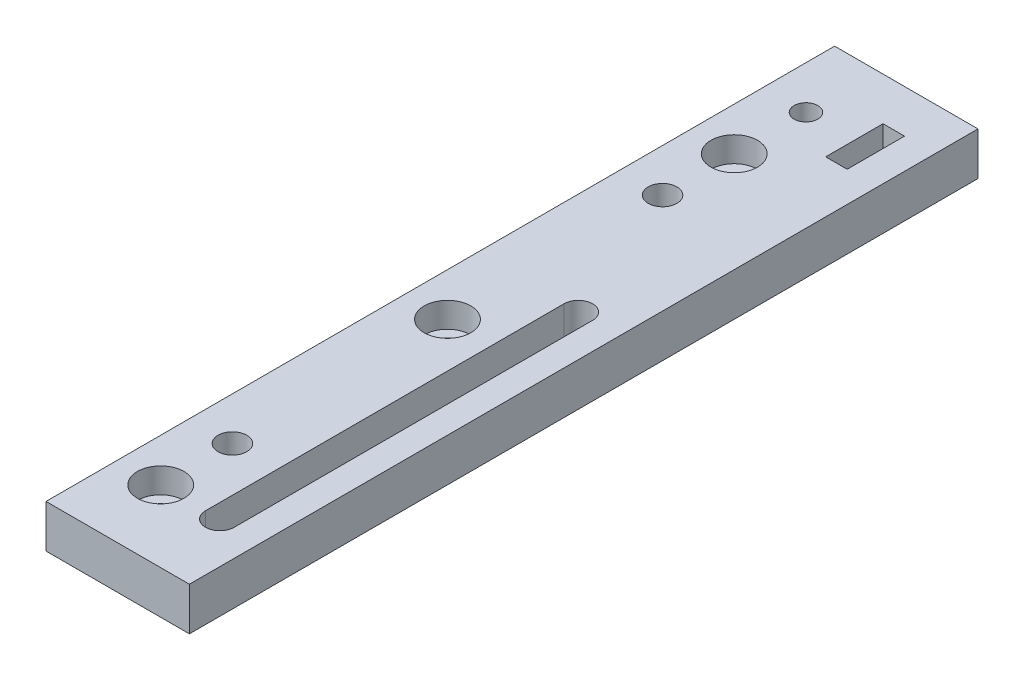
from build123d import *

# Parameters (mm, degrees)
SKETCH_1_W           = 20
SKETCH_1_H           = 6
EXTRUDE_1_DEPTH      = 110
SKETCH_2_OUTSIDE_W   = 44.392
SKETCH_2_OUTSIDE_H   = 134.392
SKETCH_2_OUTSIDE_W_2 = 20
SKETCH_2_OUTSIDE_H_2 = 110
SKETCH_2_OUTSIDE_R   = 1.75
SKETCH_2_OUTSIDE_R_2 = 2
SKETCH_2_OUTSIDE_R_3 = 1.65
SKETCH_2_OUTSIDE_W_3 = 3
SKETCH_2_OUTSIDE_H_3 = 8
CUT_EXTRUDE_1_DEPTH  = 110
SKETCH_3_R           = 3.25
CUT_EXTRUDE_2_DEPTH  = 3.5


with BuildPart() as part:
    # Sketch 1 → Extrude 1 (new body)
    with BuildSketch(Plane.XY):
        with Locations((10, 3)):
            Rectangle(SKETCH_1_W, SKETCH_1_H)
    extrude(amount=EXTRUDE_1_DEPTH)

    # Sketch 2 outside → Cut-Extrude 1 (cut)
    # profile 1 of 9: a face of its own
    with BuildSketch(Plane(origin=(0, 6, 0), x_dir=(1, 0, 0), z_dir=(0, 1, 0))):
        with Locations((10, -55)):
            Rectangle(SKETCH_2_OUTSIDE_W, SKETCH_2_OUTSIDE_H)
        with Locations((10, -55)):
            Rectangle(SKETCH_2_OUTSIDE_W_2, SKETCH_2_OUTSIDE_H_2, mode=Mode.SUBTRACT)
    # profile 2 of 9: a face of its own
    with BuildSketch(Plane(origin=(0, 6, 0), x_dir=(1, 0, 0), z_dir=(0, 1, 0))):
        with Locations(Location((6, -20, 0), (0, 0, 270))):
            Circle(SKETCH_2_OUTSIDE_R)
    # profile 3 of 9: a face of its own
    with BuildSketch(Plane(origin=(0, 6, 0), x_dir=(1, 0, 0), z_dir=(0, 1, 0))):
        with Locations(Location((6, -60, 0), (0, 0, 270))):
            Circle(SKETCH_2_OUTSIDE_R)
    # profile 4 of 9: a face of its own
    with BuildSketch(Plane(origin=(0, 6, 0), x_dir=(1, 0, 0), z_dir=(0, 1, 0))):
        with Locations(Location((6, -100, 0), (0, 0, 270))):
            Circle(SKETCH_2_OUTSIDE_R)
    # profile 5 of 9: a face of its own
    with BuildSketch(Plane(origin=(0, 6, 0), x_dir=(1, 0, 0), z_dir=(0, 1, 0))):
        with Locations(Location((6, -30, 0), (0, 0, 270))):
            Circle(SKETCH_2_OUTSIDE_R_2)
    # profile 6 of 9: a face of its own
    with BuildSketch(Plane(origin=(0, 6, 0), x_dir=(1, 0, 0), z_dir=(0, 1, 0))):
        with Locations(Location((6, -90, 0), (0, 0, 270))):
            Circle(SKETCH_2_OUTSIDE_R_2)
    # profile 7 of 9: a face of its own
    with BuildSketch(Plane(origin=(0, 6, 0), x_dir=(1, 0, 0), z_dir=(0, 1, 0))):
        with Locations(Location((6, -10, 0), (0, 0, 270))):
            Circle(SKETCH_2_OUTSIDE_R_3)
    # profile 8 of 9: a face of its own
    with BuildSketch(Plane(origin=(0, 6, 0), x_dir=(1, 0, 0), z_dir=(0, 1, 0))):
        with BuildLine():
            Line((12.25, -50), (12.25, -100))
            ThreePointArc((12.25, -100), (14.25, -102), (16.25, -100))
            Line((16.25, -100), (16.25, -50))
            ThreePointArc((16.25, -50), (14.25, -48), (12.25, -50))
        make_face()
    # profile 9 of 9: a face of its own
    with BuildSketch(Plane(origin=(0, 6, 0), x_dir=(1, 0, 0), z_dir=(0, 1, 0))):
        with Locations((14.25, -10)):
            Rectangle(SKETCH_2_OUTSIDE_W_3, SKETCH_2_OUTSIDE_H_3)
    extrude(amount=-CUT_EXTRUDE_1_DEPTH, mode=Mode.SUBTRACT)

    # Sketch 3 → Cut-Extrude 2 (cut)
    with BuildSketch(Plane(origin=(0, 6, 0), x_dir=(1, 0, 0), z_dir=(0, 1, 0))):
        with Locations(Location((6, -20, 0), (0, 0, 270))):
            Circle(SKETCH_3_R)
        with Locations(Location((6, -60, 0), (0, 0, 270))):
            Circle(SKETCH_3_R)
        with Locations(Location((6, -100, 0), (0, 0, 270))):
            Circle(SKETCH_3_R)
    extrude(amount=-CUT_EXTRUDE_2_DEPTH, mode=Mode.SUBTRACT)


solid = part.part
